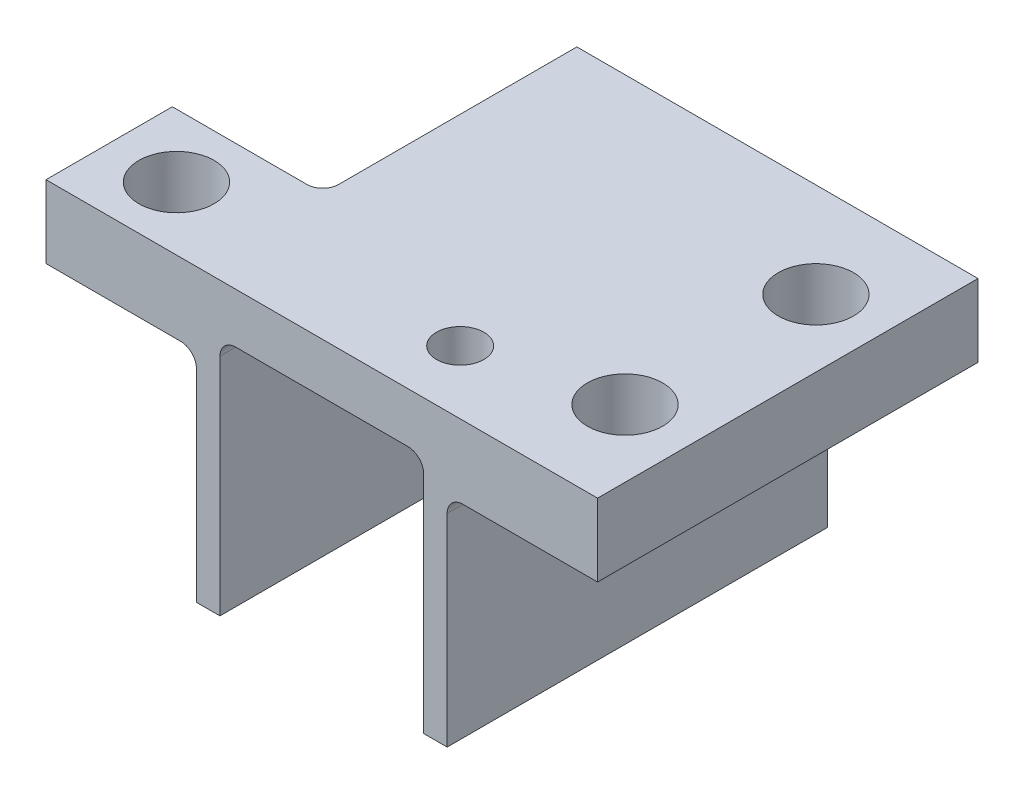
from build123d import *

# Parameters (mm, degrees)
EXTRUDE1_DEPTH     = 6.02225
FILLET1_R          = 0.5
SKETCH6_W          = 12.0445
SKETCH6_H          = 2.3
EXTRUDE2_DEPTH     = 4.7625
SKETCH5_R          = 0.75
CUT_EXTRUDE2_DEPTH = 15.045649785
FILLET2_R          = 0.5
SKETCH7_R          = 1.190625
CUT_EXTRUDE3_DEPTH = 13.657637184
SKETCH15_W         = 4.7625
SKETCH15_H         = 4
SKETCH15_R         = 1.190625
EXTRUDE9_DEPTH     = 2.3
FILLET7_R          = 0.5


with BuildPart() as part:
    # Sketch2 → Extrude1 (new, symmetric)
    with BuildSketch(Plane.XY):
        Polygon((-3.225, 0), (3.225, 0), (3.225, -7.62), (3.96875, -7.62), (3.96875, 1.5875), (-3.96875, 1.5875), (-3.96875, -7.62), (-3.225, -7.62), align=None)
    extrude(amount=EXTRUDE1_DEPTH, both=True)

    # Fillet1
    fillet1_edges = [part.edges().sort_by_distance(p)[0] for p in [
        (3.225, 0, 0),
        (-3.225, 0, 0),
    ]]
    fillet(fillet1_edges, radius=FILLET1_R)

    # Sketch6 → Extrude2 (add)
    with BuildSketch(Plane(origin=(3.96875, 0, 0), x_dir=(0, 0, -1), z_dir=(1, 0, 0))):
        with Locations((0, 0.4375)):
            Rectangle(SKETCH6_W, SKETCH6_H)
    extrude(amount=EXTRUDE2_DEPTH)

    # Sketch5 → Cut-Extrude2 (cut, through all)
    with BuildSketch(Plane.XZ.offset(-1.5875)):
        with Locations(Location((2.38125, 4.02225, 0), (0, 0, 62.720387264))):
            Circle(SKETCH5_R)
    extrude(amount=CUT_EXTRUDE2_DEPTH, mode=Mode.SUBTRACT)

    # Fillet2
    fillet2_edges = [part.edges().sort_by_distance(p)[0] for p in [
        (3.96875, -0.7125, 0),
    ]]
    fillet(fillet2_edges, radius=FILLET2_R)

    # Sketch7 → Cut-Extrude3 (cut, through all)
    with BuildSketch(Plane.XZ.offset(0.7125)):
        with Locations(Location((6.6, -3.02225, 0), (0, 0, 270))):
            Circle(SKETCH7_R)
    cut_extrude3 = extrude(amount=-CUT_EXTRUDE3_DEPTH, mode=Mode.SUBTRACT)

    # Mirror2: Cut-Extrude3 across plane
    add(cut_extrude3.mirror(Plane.XY), mode=Mode.SUBTRACT)

    # Sketch15 → Extrude9 (add)
    with BuildSketch(Plane(origin=(5.463146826, -0.7125, -6.494235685), x_dir=(-1, 0, 0), z_dir=(0, 1, 0))):
        with Locations((11.813146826, 10.516485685)):
            Rectangle(SKETCH15_W, SKETCH15_H)
        with Locations(Location((12.063146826, 10.516485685, 0), (0, 0, 180))):
            Circle(SKETCH15_R, mode=Mode.SUBTRACT)
    extrude(amount=EXTRUDE9_DEPTH)

    # Fillet7
    fillet7_edges = [part.edges().sort_by_distance(p)[0] for p in [
        (-3.96875, -0.7125, 4.02225),
        (-3.96875, 0.4375, 2.02225),
    ]]
    fillet(fillet7_edges, radius=FILLET7_R)


solid = part.part
